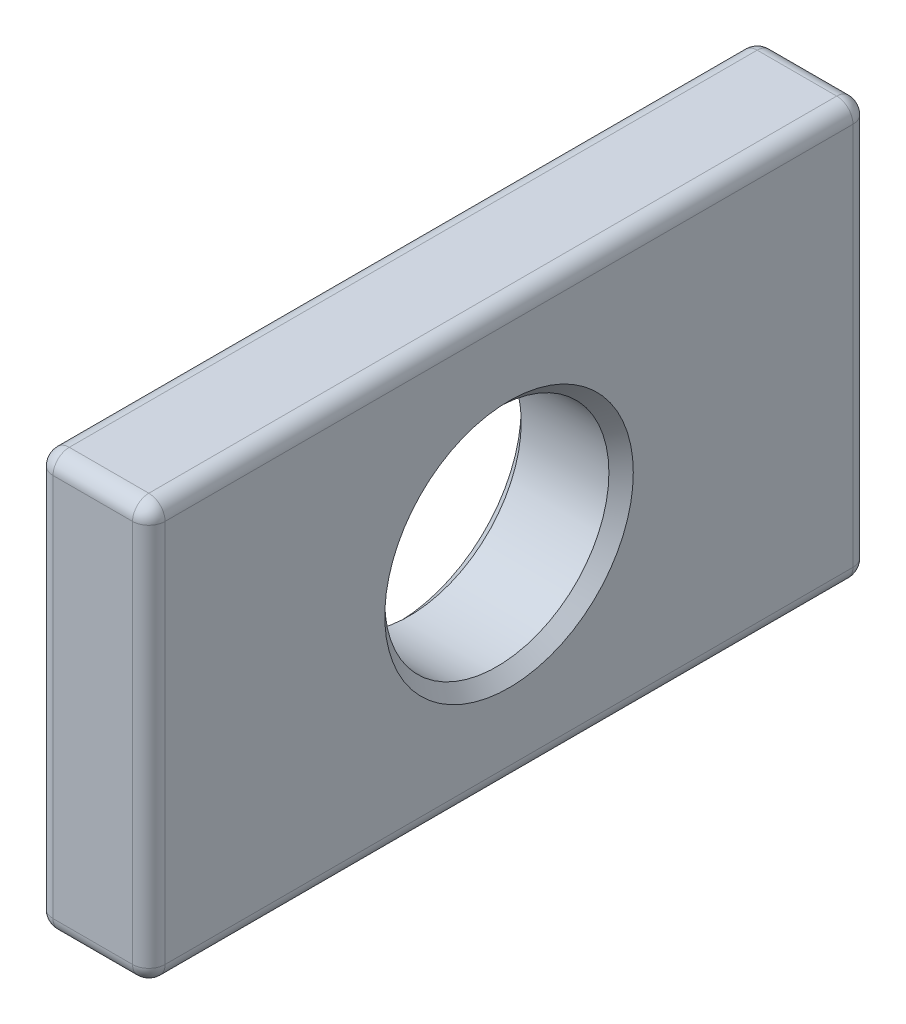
ISO-10303-21;
HEADER;
FILE_DESCRIPTION(('STEP AP214'),'2;1');
FILE_NAME('part.step','',(''),(''),'','','');
FILE_SCHEMA(('AUTOMOTIVE_DESIGN { 1 0 10303 214 1 1 1 1 }'));
ENDSEC;
DATA;
#1=APPLICATION_CONTEXT('core data for automotive mechanical design processes');
#2=APPLICATION_PROTOCOL_DEFINITION('international standard','automotive_design',2000,#1);
#3=PRODUCT_CONTEXT('',#1,'mechanical');
#4=PRODUCT('Part','Part','',(#3));
#5=PRODUCT_RELATED_PRODUCT_CATEGORY('part','',(#4));
#6=PRODUCT_DEFINITION_FORMATION('','',#4);
#7=PRODUCT_DEFINITION_CONTEXT('part definition',#1,'design');
#8=PRODUCT_DEFINITION('design','',#6,#7);
#9=PRODUCT_DEFINITION_SHAPE('','',#8);
#10=(LENGTH_UNIT() NAMED_UNIT(*) SI_UNIT(.MILLI.,.METRE.));
#11=(NAMED_UNIT(*) PLANE_ANGLE_UNIT() SI_UNIT($,.RADIAN.));
#12=(NAMED_UNIT(*) SI_UNIT($,.STERADIAN.) SOLID_ANGLE_UNIT());
#13=UNCERTAINTY_MEASURE_WITH_UNIT(LENGTH_MEASURE(1.E-05),#10,'distance_accuracy_value','');
#14=(GEOMETRIC_REPRESENTATION_CONTEXT(3) GLOBAL_UNCERTAINTY_ASSIGNED_CONTEXT((#13)) GLOBAL_UNIT_ASSIGNED_CONTEXT((#10,
#11,#12)) REPRESENTATION_CONTEXT('',''));
#15=CARTESIAN_POINT('',(0.,0.,0.));
#16=DIRECTION('',(0.,0.,1.));
#17=DIRECTION('',(1.,0.,0.));
#18=AXIS2_PLACEMENT_3D('',#15,#16,#17);
#19=CARTESIAN_POINT('',(3.5,0.,0.));
#20=DIRECTION('',(1.,0.,0.));
#21=DIRECTION('',(0.,0.,-1.));
#22=AXIS2_PLACEMENT_3D('',#19,#20,#21);
#23=PLANE('',#22);
#24=CARTESIAN_POINT('',(3.5,0.,0.));
#25=DIRECTION('',(1.,0.,0.));
#26=DIRECTION('',(0.,0.,-1.));
#27=AXIS2_PLACEMENT_3D('',#24,#25,#26);
#28=CIRCLE('',#27,7.762);
#29=CARTESIAN_POINT('',(3.5,0.,-7.762));
#30=VERTEX_POINT('',#29);
#31=EDGE_CURVE('E11',#30,#30,#28,.F.);
#32=ORIENTED_EDGE('',*,*,#31,.T.);
#33=EDGE_LOOP('',(#32));
#34=FACE_BOUND('',#33,.T.);
#35=DIRECTION('',(0.,0.,-1.));
#36=VECTOR('',#35,1.);
#37=CARTESIAN_POINT('',(3.5,-11.984,-22.5));
#38=LINE('',#37,#36);
#39=CARTESIAN_POINT('',(3.5,-11.984,21.484));
#40=VERTEX_POINT('',#39);
#41=CARTESIAN_POINT('',(3.5,-11.984,-21.484));
#42=VERTEX_POINT('',#41);
#43=EDGE_CURVE('E130',#40,#42,#38,.T.);
#44=ORIENTED_EDGE('',*,*,#43,.T.);
#45=DIRECTION('',(0.,1.,0.));
#46=VECTOR('',#45,1.);
#47=CARTESIAN_POINT('',(3.5,13.,-21.484));
#48=LINE('',#47,#46);
#49=CARTESIAN_POINT('',(3.5,11.984,-21.484));
#50=VERTEX_POINT('',#49);
#51=EDGE_CURVE('E126',#42,#50,#48,.T.);
#52=ORIENTED_EDGE('',*,*,#51,.T.);
#53=DIRECTION('',(0.,0.,1.));
#54=VECTOR('',#53,1.);
#55=CARTESIAN_POINT('',(3.5,11.984,22.5));
#56=LINE('',#55,#54);
#57=CARTESIAN_POINT('',(3.5,11.984,21.484));
#58=VERTEX_POINT('',#57);
#59=EDGE_CURVE('E119',#50,#58,#56,.T.);
#60=ORIENTED_EDGE('',*,*,#59,.T.);
#61=DIRECTION('',(0.,-1.,0.));
#62=VECTOR('',#61,1.);
#63=CARTESIAN_POINT('',(3.5,-13.,21.484));
#64=LINE('',#63,#62);
#65=EDGE_CURVE('E123',#58,#40,#64,.T.);
#66=ORIENTED_EDGE('',*,*,#65,.T.);
#67=EDGE_LOOP('',(#44,#52,#60,#66));
#68=FACE_BOUND('',#67,.T.);
#69=ADVANCED_FACE('F32',(#34,#68),#23,.T.);
#70=CARTESIAN_POINT('',(-3.5,0.,0.));
#71=DIRECTION('',(1.,0.,0.));
#72=DIRECTION('',(0.,0.,-1.));
#73=AXIS2_PLACEMENT_3D('',#70,#71,#72);
#74=PLANE('',#73);
#75=CARTESIAN_POINT('',(-3.5,0.,0.));
#76=DIRECTION('',(1.,0.,0.));
#77=DIRECTION('',(0.,0.,-1.));
#78=AXIS2_PLACEMENT_3D('',#75,#76,#77);
#79=CIRCLE('',#78,7.76200000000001);
#80=CARTESIAN_POINT('',(-3.5,0.,-7.762));
#81=VERTEX_POINT('',#80);
#82=EDGE_CURVE('E204',#81,#81,#79,.T.);
#83=ORIENTED_EDGE('',*,*,#82,.T.);
#84=EDGE_LOOP('',(#83));
#85=FACE_BOUND('',#84,.T.);
#86=DIRECTION('',(0.,0.,1.));
#87=VECTOR('',#86,1.);
#88=CARTESIAN_POINT('',(-3.5,11.984,0.));
#89=LINE('',#88,#87);
#90=CARTESIAN_POINT('',(-3.5,11.984,21.484));
#91=VERTEX_POINT('',#90);
#92=CARTESIAN_POINT('',(-3.5,11.984,-21.484));
#93=VERTEX_POINT('',#92);
#94=EDGE_CURVE('E175',#91,#93,#89,.F.);
#95=ORIENTED_EDGE('',*,*,#94,.T.);
#96=DIRECTION('',(0.,1.,0.));
#97=VECTOR('',#96,1.);
#98=CARTESIAN_POINT('',(-3.5,0.,-21.484));
#99=LINE('',#98,#97);
#100=CARTESIAN_POINT('',(-3.5,-11.984,-21.484));
#101=VERTEX_POINT('',#100);
#102=EDGE_CURVE('E180',#93,#101,#99,.F.);
#103=ORIENTED_EDGE('',*,*,#102,.T.);
#104=DIRECTION('',(0.,0.,-1.));
#105=VECTOR('',#104,1.);
#106=CARTESIAN_POINT('',(-3.5,-11.984,0.));
#107=LINE('',#106,#105);
#108=CARTESIAN_POINT('',(-3.5,-11.984,21.484));
#109=VERTEX_POINT('',#108);
#110=EDGE_CURVE('E177',#101,#109,#107,.F.);
#111=ORIENTED_EDGE('',*,*,#110,.T.);
#112=DIRECTION('',(0.,-1.,0.));
#113=VECTOR('',#112,1.);
#114=CARTESIAN_POINT('',(-3.5,0.,21.484));
#115=LINE('',#114,#113);
#116=EDGE_CURVE('E173',#109,#91,#115,.F.);
#117=ORIENTED_EDGE('',*,*,#116,.T.);
#118=EDGE_LOOP('',(#95,#103,#111,#117));
#119=FACE_BOUND('',#118,.T.);
#120=ADVANCED_FACE('F270',(#85,#119),#74,.F.);
#121=CARTESIAN_POINT('',(3.5,13.,-22.5));
#122=DIRECTION('',(0.,0.,1.));
#123=DIRECTION('',(0.,-1.,0.));
#124=AXIS2_PLACEMENT_3D('',#121,#122,#123);
#125=PLANE('',#124);
#126=DIRECTION('',(0.,1.,0.));
#127=VECTOR('',#126,1.);
#128=CARTESIAN_POINT('',(2.484,-13.,-22.5));
#129=LINE('',#128,#127);
#130=CARTESIAN_POINT('',(2.484,11.984,-22.5));
#131=VERTEX_POINT('',#130);
#132=CARTESIAN_POINT('',(2.484,-11.984,-22.5));
#133=VERTEX_POINT('',#132);
#134=EDGE_CURVE('E193',#131,#133,#129,.F.);
#135=ORIENTED_EDGE('',*,*,#134,.T.);
#136=DIRECTION('',(-1.,0.,0.));
#137=VECTOR('',#136,1.);
#138=CARTESIAN_POINT('',(3.5,-11.984,-22.5));
#139=LINE('',#138,#137);
#140=CARTESIAN_POINT('',(-2.484,-11.984,-22.5));
#141=VERTEX_POINT('',#140);
#142=EDGE_CURVE('E195',#133,#141,#139,.T.);
#143=ORIENTED_EDGE('',*,*,#142,.T.);
#144=DIRECTION('',(0.,1.,0.));
#145=VECTOR('',#144,1.);
#146=CARTESIAN_POINT('',(-2.484,13.,-22.5));
#147=LINE('',#146,#145);
#148=CARTESIAN_POINT('',(-2.484,11.984,-22.5));
#149=VERTEX_POINT('',#148);
#150=EDGE_CURVE('E189',#141,#149,#147,.T.);
#151=ORIENTED_EDGE('',*,*,#150,.T.);
#152=DIRECTION('',(-1.,0.,0.));
#153=VECTOR('',#152,1.);
#154=CARTESIAN_POINT('',(3.5,11.984,-22.5));
#155=LINE('',#154,#153);
#156=EDGE_CURVE('E191',#149,#131,#155,.F.);
#157=ORIENTED_EDGE('',*,*,#156,.T.);
#158=EDGE_LOOP('',(#135,#143,#151,#157));
#159=FACE_BOUND('',#158,.T.);
#160=ADVANCED_FACE('F273',(#159),#125,.F.);
#161=CARTESIAN_POINT('',(3.5,13.,22.5));
#162=DIRECTION('',(0.,-1.,0.));
#163=DIRECTION('',(0.,0.,-1.));
#164=AXIS2_PLACEMENT_3D('',#161,#162,#163);
#165=PLANE('',#164);
#166=DIRECTION('',(0.,0.,1.));
#167=VECTOR('',#166,1.);
#168=CARTESIAN_POINT('',(2.484,13.,-22.5));
#169=LINE('',#168,#167);
#170=CARTESIAN_POINT('',(2.484,13.,21.484));
#171=VERTEX_POINT('',#170);
#172=CARTESIAN_POINT('',(2.484,13.,-21.484));
#173=VERTEX_POINT('',#172);
#174=EDGE_CURVE('E138',#171,#173,#169,.F.);
#175=ORIENTED_EDGE('',*,*,#174,.T.);
#176=DIRECTION('',(-1.,0.,0.));
#177=VECTOR('',#176,1.);
#178=CARTESIAN_POINT('',(3.5,13.,-21.484));
#179=LINE('',#178,#177);
#180=CARTESIAN_POINT('',(-2.484,13.,-21.484));
#181=VERTEX_POINT('',#180);
#182=EDGE_CURVE('E187',#173,#181,#179,.T.);
#183=ORIENTED_EDGE('',*,*,#182,.T.);
#184=DIRECTION('',(0.,0.,1.));
#185=VECTOR('',#184,1.);
#186=CARTESIAN_POINT('',(-2.484,13.,22.5));
#187=LINE('',#186,#185);
#188=CARTESIAN_POINT('',(-2.484,13.,21.484));
#189=VERTEX_POINT('',#188);
#190=EDGE_CURVE('E184',#181,#189,#187,.T.);
#191=ORIENTED_EDGE('',*,*,#190,.T.);
#192=DIRECTION('',(-1.,0.,0.));
#193=VECTOR('',#192,1.);
#194=CARTESIAN_POINT('',(3.5,13.,21.484));
#195=LINE('',#194,#193);
#196=EDGE_CURVE('E182',#189,#171,#195,.F.);
#197=ORIENTED_EDGE('',*,*,#196,.T.);
#198=EDGE_LOOP('',(#175,#183,#191,#197));
#199=FACE_BOUND('',#198,.T.);
#200=ADVANCED_FACE('F317',(#199),#165,.F.);
#201=CARTESIAN_POINT('',(3.5,13.,22.5));
#202=DIRECTION('',(0.,0.,-1.));
#203=DIRECTION('',(-1.,0.,0.));
#204=AXIS2_PLACEMENT_3D('',#201,#202,#203);
#205=PLANE('',#204);
#206=DIRECTION('',(0.,-1.,0.));
#207=VECTOR('',#206,1.);
#208=CARTESIAN_POINT('',(2.484,13.,22.5));
#209=LINE('',#208,#207);
#210=CARTESIAN_POINT('',(2.484,-11.984,22.5));
#211=VERTEX_POINT('',#210);
#212=CARTESIAN_POINT('',(2.484,11.984,22.5));
#213=VERTEX_POINT('',#212);
#214=EDGE_CURVE('E47',#211,#213,#209,.F.);
#215=ORIENTED_EDGE('',*,*,#214,.T.);
#216=DIRECTION('',(-1.,0.,0.));
#217=VECTOR('',#216,1.);
#218=CARTESIAN_POINT('',(3.5,11.984,22.5));
#219=LINE('',#218,#217);
#220=CARTESIAN_POINT('',(-2.484,11.984,22.5));
#221=VERTEX_POINT('',#220);
#222=EDGE_CURVE('E202',#213,#221,#219,.T.);
#223=ORIENTED_EDGE('',*,*,#222,.T.);
#224=DIRECTION('',(0.,-1.,0.));
#225=VECTOR('',#224,1.);
#226=CARTESIAN_POINT('',(-2.484,13.,22.5));
#227=LINE('',#226,#225);
#228=CARTESIAN_POINT('',(-2.484,-11.984,22.5));
#229=VERTEX_POINT('',#228);
#230=EDGE_CURVE('E198',#221,#229,#227,.T.);
#231=ORIENTED_EDGE('',*,*,#230,.T.);
#232=DIRECTION('',(-1.,0.,0.));
#233=VECTOR('',#232,1.);
#234=CARTESIAN_POINT('',(3.5,-11.984,22.5));
#235=LINE('',#234,#233);
#236=EDGE_CURVE('E52',#229,#211,#235,.F.);
#237=ORIENTED_EDGE('',*,*,#236,.T.);
#238=EDGE_LOOP('',(#215,#223,#231,#237));
#239=FACE_BOUND('',#238,.T.);
#240=ADVANCED_FACE('F314',(#239),#205,.F.);
#241=CARTESIAN_POINT('',(3.5,-13.,22.5));
#242=DIRECTION('',(0.,1.,0.));
#243=DIRECTION('',(0.,0.,1.));
#244=AXIS2_PLACEMENT_3D('',#241,#242,#243);
#245=PLANE('',#244);
#246=DIRECTION('',(0.,0.,-1.));
#247=VECTOR('',#246,1.);
#248=CARTESIAN_POINT('',(-2.484,-13.,22.5));
#249=LINE('',#248,#247);
#250=CARTESIAN_POINT('',(-2.484,-13.,21.484));
#251=VERTEX_POINT('',#250);
#252=CARTESIAN_POINT('',(-2.484,-13.,-21.484));
#253=VERTEX_POINT('',#252);
#254=EDGE_CURVE('E166',#251,#253,#249,.T.);
#255=ORIENTED_EDGE('',*,*,#254,.T.);
#256=DIRECTION('',(-1.,0.,0.));
#257=VECTOR('',#256,1.);
#258=CARTESIAN_POINT('',(3.5,-13.,-21.484));
#259=LINE('',#258,#257);
#260=CARTESIAN_POINT('',(2.484,-13.,-21.484));
#261=VERTEX_POINT('',#260);
#262=EDGE_CURVE('E171',#253,#261,#259,.F.);
#263=ORIENTED_EDGE('',*,*,#262,.T.);
#264=DIRECTION('',(0.,0.,-1.));
#265=VECTOR('',#264,1.);
#266=CARTESIAN_POINT('',(2.484,-13.,22.5));
#267=LINE('',#266,#265);
#268=CARTESIAN_POINT('',(2.484,-13.,21.484));
#269=VERTEX_POINT('',#268);
#270=EDGE_CURVE('E168',#261,#269,#267,.F.);
#271=ORIENTED_EDGE('',*,*,#270,.T.);
#272=DIRECTION('',(-1.,0.,0.));
#273=VECTOR('',#272,1.);
#274=CARTESIAN_POINT('',(3.5,-13.,21.484));
#275=LINE('',#274,#273);
#276=EDGE_CURVE('E164',#269,#251,#275,.T.);
#277=ORIENTED_EDGE('',*,*,#276,.T.);
#278=EDGE_LOOP('',(#255,#263,#271,#277));
#279=FACE_BOUND('',#278,.T.);
#280=ADVANCED_FACE('F316',(#279),#245,.F.);
#281=CARTESIAN_POINT('',(3.5,0.,0.));
#282=DIRECTION('',(-1.,0.,0.));
#283=DIRECTION('',(0.,0.,1.));
#284=AXIS2_PLACEMENT_3D('',#281,#282,#283);
#285=CYLINDRICAL_SURFACE('',#284,7.);
#286=CARTESIAN_POINT('',(-2.73799999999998,0.,0.));
#287=DIRECTION('',(1.,0.,0.));
#288=DIRECTION('',(0.,0.,-1.));
#289=AXIS2_PLACEMENT_3D('',#286,#287,#288);
#290=CIRCLE('',#289,7.);
#291=CARTESIAN_POINT('',(-2.73799999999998,0.,-6.99999999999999));
#292=VERTEX_POINT('',#291);
#293=EDGE_CURVE('E40',#292,#292,#290,.F.);
#294=ORIENTED_EDGE('',*,*,#293,.T.);
#295=EDGE_LOOP('',(#294));
#296=FACE_BOUND('',#295,.T.);
#297=CARTESIAN_POINT('',(2.738,0.,0.));
#298=DIRECTION('',(1.,0.,0.));
#299=DIRECTION('',(0.,0.,-1.));
#300=AXIS2_PLACEMENT_3D('',#297,#298,#299);
#301=CIRCLE('',#300,7.);
#302=CARTESIAN_POINT('',(2.738,0.,-6.99999999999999));
#303=VERTEX_POINT('',#302);
#304=EDGE_CURVE('E256',#303,#303,#301,.T.);
#305=ORIENTED_EDGE('',*,*,#304,.T.);
#306=EDGE_LOOP('',(#305));
#307=FACE_BOUND('',#306,.T.);
#308=ADVANCED_FACE('F261',(#296,#307),#285,.F.);
#309=CARTESIAN_POINT('',(-2.484,11.984,22.5));
#310=DIRECTION('',(0.,0.,1.));
#311=DIRECTION('',(1.,0.,0.));
#312=AXIS2_PLACEMENT_3D('',#309,#310,#311);
#313=CYLINDRICAL_SURFACE('',#312,1.016);
#314=CARTESIAN_POINT('',(-2.484,11.984,21.484));
#315=DIRECTION('',(0.,0.,1.));
#316=DIRECTION('',(1.,0.,0.));
#317=AXIS2_PLACEMENT_3D('',#314,#315,#316);
#318=CIRCLE('',#317,1.016);
#319=EDGE_CURVE('E156',#189,#91,#318,.T.);
#320=ORIENTED_EDGE('',*,*,#319,.F.);
#321=ORIENTED_EDGE('',*,*,#190,.F.);
#322=CARTESIAN_POINT('',(-2.484,11.984,-21.484));
#323=DIRECTION('',(0.,0.,-1.));
#324=DIRECTION('',(0.,1.,0.));
#325=AXIS2_PLACEMENT_3D('',#322,#323,#324);
#326=CIRCLE('',#325,1.016);
#327=EDGE_CURVE('E159',#93,#181,#326,.T.);
#328=ORIENTED_EDGE('',*,*,#327,.F.);
#329=ORIENTED_EDGE('',*,*,#94,.F.);
#330=EDGE_LOOP('',(#320,#321,#328,#329));
#331=FACE_BOUND('',#330,.T.);
#332=ADVANCED_FACE('F284',(#331),#313,.T.);
#333=CARTESIAN_POINT('',(-2.484,11.984,21.484));
#334=DIRECTION('',(0.,0.,1.));
#335=DIRECTION('',(1.,0.,0.));
#336=AXIS2_PLACEMENT_3D('',#333,#334,#335);
#337=SPHERICAL_SURFACE('',#336,1.016);
#338=CARTESIAN_POINT('',(-2.484,11.984,21.484));
#339=DIRECTION('',(-1.,0.,0.));
#340=DIRECTION('',(0.,0.,1.));
#341=AXIS2_PLACEMENT_3D('',#338,#339,#340);
#342=CIRCLE('',#341,1.016);
#343=EDGE_CURVE('E246',#189,#221,#342,.F.);
#344=ORIENTED_EDGE('',*,*,#343,.F.);
#345=ORIENTED_EDGE('',*,*,#319,.T.);
#346=CARTESIAN_POINT('',(-2.484,11.984,21.484));
#347=DIRECTION('',(0.,1.,0.));
#348=DIRECTION('',(0.,0.,1.));
#349=AXIS2_PLACEMENT_3D('',#346,#347,#348);
#350=CIRCLE('',#349,1.016);
#351=EDGE_CURVE('E249',#221,#91,#350,.F.);
#352=ORIENTED_EDGE('',*,*,#351,.F.);
#353=EDGE_LOOP('',(#344,#345,#352));
#354=FACE_BOUND('',#353,.T.);
#355=ADVANCED_FACE('F310',(#354),#337,.T.);
#356=CARTESIAN_POINT('',(-2.484,11.984,-21.484));
#357=DIRECTION('',(0.,0.,1.));
#358=DIRECTION('',(1.,0.,0.));
#359=AXIS2_PLACEMENT_3D('',#356,#357,#358);
#360=SPHERICAL_SURFACE('',#359,1.016);
#361=CARTESIAN_POINT('',(-2.484,11.984,-21.484));
#362=DIRECTION('',(0.,1.,0.));
#363=DIRECTION('',(0.,0.,1.));
#364=AXIS2_PLACEMENT_3D('',#361,#362,#363);
#365=CIRCLE('',#364,1.016);
#366=EDGE_CURVE('E240',#93,#149,#365,.F.);
#367=ORIENTED_EDGE('',*,*,#366,.F.);
#368=ORIENTED_EDGE('',*,*,#327,.T.);
#369=CARTESIAN_POINT('',(-2.484,11.984,-21.484));
#370=DIRECTION('',(-1.,0.,0.));
#371=DIRECTION('',(0.,0.,1.));
#372=AXIS2_PLACEMENT_3D('',#369,#370,#371);
#373=CIRCLE('',#372,1.016);
#374=EDGE_CURVE('E243',#149,#181,#373,.F.);
#375=ORIENTED_EDGE('',*,*,#374,.F.);
#376=EDGE_LOOP('',(#367,#368,#375));
#377=FACE_BOUND('',#376,.T.);
#378=ADVANCED_FACE('F287',(#377),#360,.T.);
#379=CARTESIAN_POINT('',(-2.484,13.,21.484));
#380=DIRECTION('',(0.,-1.,0.));
#381=DIRECTION('',(0.,0.,-1.));
#382=AXIS2_PLACEMENT_3D('',#379,#380,#381);
#383=CYLINDRICAL_SURFACE('',#382,1.016);
#384=ORIENTED_EDGE('',*,*,#351,.T.);
#385=ORIENTED_EDGE('',*,*,#116,.F.);
#386=CARTESIAN_POINT('',(-2.484,-11.984,21.484));
#387=DIRECTION('',(0.,-1.,0.));
#388=DIRECTION('',(0.,0.,-1.));
#389=AXIS2_PLACEMENT_3D('',#386,#387,#388);
#390=CIRCLE('',#389,1.016);
#391=EDGE_CURVE('E235',#229,#109,#390,.T.);
#392=ORIENTED_EDGE('',*,*,#391,.F.);
#393=ORIENTED_EDGE('',*,*,#230,.F.);
#394=EDGE_LOOP('',(#384,#385,#392,#393));
#395=FACE_BOUND('',#394,.T.);
#396=ADVANCED_FACE('F306',(#395),#383,.T.);
#397=CARTESIAN_POINT('',(3.5,11.984,21.484));
#398=DIRECTION('',(-1.,0.,0.));
#399=DIRECTION('',(0.,0.,1.));
#400=AXIS2_PLACEMENT_3D('',#397,#398,#399);
#401=CYLINDRICAL_SURFACE('',#400,1.016);
#402=ORIENTED_EDGE('',*,*,#343,.T.);
#403=ORIENTED_EDGE('',*,*,#222,.F.);
#404=CARTESIAN_POINT('',(2.484,11.984,21.484));
#405=DIRECTION('',(1.,0.,0.));
#406=DIRECTION('',(0.,0.,-1.));
#407=AXIS2_PLACEMENT_3D('',#404,#405,#406);
#408=CIRCLE('',#407,1.016);
#409=EDGE_CURVE('E142',#171,#213,#408,.T.);
#410=ORIENTED_EDGE('',*,*,#409,.F.);
#411=ORIENTED_EDGE('',*,*,#196,.F.);
#412=EDGE_LOOP('',(#402,#403,#410,#411));
#413=FACE_BOUND('',#412,.T.);
#414=ADVANCED_FACE('F313',(#413),#401,.T.);
#415=CARTESIAN_POINT('',(2.484,11.984,0.));
#416=DIRECTION('',(0.,0.,-1.));
#417=DIRECTION('',(-1.,0.,0.));
#418=AXIS2_PLACEMENT_3D('',#415,#416,#417);
#419=CYLINDRICAL_SURFACE('',#418,1.016);
#420=CARTESIAN_POINT('',(2.484,11.984,-21.484));
#421=DIRECTION('',(0.,0.,-1.));
#422=DIRECTION('',(-1.,0.,0.));
#423=AXIS2_PLACEMENT_3D('',#420,#421,#422);
#424=CIRCLE('',#423,1.016);
#425=EDGE_CURVE('E143',#173,#50,#424,.T.);
#426=ORIENTED_EDGE('',*,*,#425,.F.);
#427=ORIENTED_EDGE('',*,*,#174,.F.);
#428=CARTESIAN_POINT('',(2.484,11.984,21.484));
#429=DIRECTION('',(0.,0.,1.));
#430=DIRECTION('',(1.,0.,0.));
#431=AXIS2_PLACEMENT_3D('',#428,#429,#430);
#432=CIRCLE('',#431,1.016);
#433=EDGE_CURVE('E134',#58,#171,#432,.T.);
#434=ORIENTED_EDGE('',*,*,#433,.F.);
#435=ORIENTED_EDGE('',*,*,#59,.F.);
#436=EDGE_LOOP('',(#426,#427,#434,#435));
#437=FACE_BOUND('',#436,.T.);
#438=ADVANCED_FACE('F136',(#437),#419,.T.);
#439=CARTESIAN_POINT('',(3.5,11.984,-21.484));
#440=DIRECTION('',(-1.,0.,0.));
#441=DIRECTION('',(0.,0.,1.));
#442=AXIS2_PLACEMENT_3D('',#439,#440,#441);
#443=CYLINDRICAL_SURFACE('',#442,1.016);
#444=ORIENTED_EDGE('',*,*,#374,.T.);
#445=ORIENTED_EDGE('',*,*,#182,.F.);
#446=CARTESIAN_POINT('',(2.484,11.984,-21.484));
#447=DIRECTION('',(1.,0.,0.));
#448=DIRECTION('',(0.,0.,-1.));
#449=AXIS2_PLACEMENT_3D('',#446,#447,#448);
#450=CIRCLE('',#449,1.016);
#451=EDGE_CURVE('E231',#131,#173,#450,.T.);
#452=ORIENTED_EDGE('',*,*,#451,.F.);
#453=ORIENTED_EDGE('',*,*,#156,.F.);
#454=EDGE_LOOP('',(#444,#445,#452,#453));
#455=FACE_BOUND('',#454,.T.);
#456=ADVANCED_FACE('F351',(#455),#443,.T.);
#457=CARTESIAN_POINT('',(-2.484,13.,-21.484));
#458=DIRECTION('',(0.,1.,0.));
#459=DIRECTION('',(0.,0.,1.));
#460=AXIS2_PLACEMENT_3D('',#457,#458,#459);
#461=CYLINDRICAL_SURFACE('',#460,1.016);
#462=ORIENTED_EDGE('',*,*,#366,.T.);
#463=ORIENTED_EDGE('',*,*,#150,.F.);
#464=CARTESIAN_POINT('',(-2.484,-11.984,-21.484));
#465=DIRECTION('',(0.,-1.,0.));
#466=DIRECTION('',(0.,0.,-1.));
#467=AXIS2_PLACEMENT_3D('',#464,#465,#466);
#468=CIRCLE('',#467,1.016);
#469=EDGE_CURVE('E228',#101,#141,#468,.T.);
#470=ORIENTED_EDGE('',*,*,#469,.F.);
#471=ORIENTED_EDGE('',*,*,#102,.F.);
#472=EDGE_LOOP('',(#462,#463,#470,#471));
#473=FACE_BOUND('',#472,.T.);
#474=ADVANCED_FACE('F292',(#473),#461,.T.);
#475=CARTESIAN_POINT('',(-2.484,-11.984,22.5));
#476=DIRECTION('',(0.,0.,-1.));
#477=DIRECTION('',(-1.,0.,0.));
#478=AXIS2_PLACEMENT_3D('',#475,#476,#477);
#479=CYLINDRICAL_SURFACE('',#478,1.016);
#480=CARTESIAN_POINT('',(-2.484,-11.984,21.484));
#481=DIRECTION('',(0.,0.,1.));
#482=DIRECTION('',(1.,0.,0.));
#483=AXIS2_PLACEMENT_3D('',#480,#481,#482);
#484=CIRCLE('',#483,1.016);
#485=EDGE_CURVE('E237',#109,#251,#484,.T.);
#486=ORIENTED_EDGE('',*,*,#485,.F.);
#487=ORIENTED_EDGE('',*,*,#110,.F.);
#488=CARTESIAN_POINT('',(-2.484,-11.984,-21.484));
#489=DIRECTION('',(0.,0.,-1.));
#490=DIRECTION('',(-1.,0.,0.));
#491=AXIS2_PLACEMENT_3D('',#488,#489,#490);
#492=CIRCLE('',#491,1.016);
#493=EDGE_CURVE('E225',#253,#101,#492,.T.);
#494=ORIENTED_EDGE('',*,*,#493,.F.);
#495=ORIENTED_EDGE('',*,*,#254,.F.);
#496=EDGE_LOOP('',(#486,#487,#494,#495));
#497=FACE_BOUND('',#496,.T.);
#498=ADVANCED_FACE('F301',(#497),#479,.T.);
#499=CARTESIAN_POINT('',(-2.484,-11.984,21.484));
#500=DIRECTION('',(0.,0.,1.));
#501=DIRECTION('',(1.,0.,0.));
#502=AXIS2_PLACEMENT_3D('',#499,#500,#501);
#503=SPHERICAL_SURFACE('',#502,1.016);
#504=ORIENTED_EDGE('',*,*,#391,.T.);
#505=ORIENTED_EDGE('',*,*,#485,.T.);
#506=CARTESIAN_POINT('',(-2.484,-11.984,21.484));
#507=DIRECTION('',(-1.,0.,0.));
#508=DIRECTION('',(0.,0.,1.));
#509=AXIS2_PLACEMENT_3D('',#506,#507,#508);
#510=CIRCLE('',#509,1.016);
#511=EDGE_CURVE('E149',#229,#251,#510,.F.);
#512=ORIENTED_EDGE('',*,*,#511,.F.);
#513=EDGE_LOOP('',(#504,#505,#512));
#514=FACE_BOUND('',#513,.T.);
#515=ADVANCED_FACE('F359',(#514),#503,.T.);
#516=CARTESIAN_POINT('',(2.484,11.984,21.484));
#517=DIRECTION('',(0.,0.,1.));
#518=DIRECTION('',(1.,0.,0.));
#519=AXIS2_PLACEMENT_3D('',#516,#517,#518);
#520=SPHERICAL_SURFACE('',#519,1.016);
#521=ORIENTED_EDGE('',*,*,#433,.T.);
#522=ORIENTED_EDGE('',*,*,#409,.T.);
#523=CARTESIAN_POINT('',(2.484,11.984,21.484));
#524=DIRECTION('',(0.,1.,0.));
#525=DIRECTION('',(0.,0.,1.));
#526=AXIS2_PLACEMENT_3D('',#523,#524,#525);
#527=CIRCLE('',#526,1.016);
#528=EDGE_CURVE('E146',#58,#213,#527,.F.);
#529=ORIENTED_EDGE('',*,*,#528,.F.);
#530=EDGE_LOOP('',(#521,#522,#529));
#531=FACE_BOUND('',#530,.T.);
#532=ADVANCED_FACE('F147',(#531),#520,.T.);
#533=CARTESIAN_POINT('',(2.484,11.984,-21.484));
#534=DIRECTION('',(0.,0.,1.));
#535=DIRECTION('',(1.,0.,0.));
#536=AXIS2_PLACEMENT_3D('',#533,#534,#535);
#537=SPHERICAL_SURFACE('',#536,1.016);
#538=ORIENTED_EDGE('',*,*,#451,.T.);
#539=ORIENTED_EDGE('',*,*,#425,.T.);
#540=CARTESIAN_POINT('',(2.484,11.984,-21.484));
#541=DIRECTION('',(0.,1.,0.));
#542=DIRECTION('',(0.,0.,1.));
#543=AXIS2_PLACEMENT_3D('',#540,#541,#542);
#544=CIRCLE('',#543,1.016);
#545=EDGE_CURVE('E150',#131,#50,#544,.F.);
#546=ORIENTED_EDGE('',*,*,#545,.F.);
#547=EDGE_LOOP('',(#538,#539,#546));
#548=FACE_BOUND('',#547,.T.);
#549=ADVANCED_FACE('F364',(#548),#537,.T.);
#550=CARTESIAN_POINT('',(-2.484,-11.984,-21.484));
#551=DIRECTION('',(0.,0.,1.));
#552=DIRECTION('',(1.,0.,0.));
#553=AXIS2_PLACEMENT_3D('',#550,#551,#552);
#554=SPHERICAL_SURFACE('',#553,1.016);
#555=ORIENTED_EDGE('',*,*,#493,.T.);
#556=ORIENTED_EDGE('',*,*,#469,.T.);
#557=CARTESIAN_POINT('',(-2.484,-11.984,-21.484));
#558=DIRECTION('',(-1.,0.,0.));
#559=DIRECTION('',(0.,0.,1.));
#560=AXIS2_PLACEMENT_3D('',#557,#558,#559);
#561=CIRCLE('',#560,1.016);
#562=EDGE_CURVE('E219',#253,#141,#561,.F.);
#563=ORIENTED_EDGE('',*,*,#562,.F.);
#564=EDGE_LOOP('',(#555,#556,#563));
#565=FACE_BOUND('',#564,.T.);
#566=ADVANCED_FACE('F296',(#565),#554,.T.);
#567=CARTESIAN_POINT('',(3.5,-11.984,21.484));
#568=DIRECTION('',(-1.,0.,0.));
#569=DIRECTION('',(0.,0.,1.));
#570=AXIS2_PLACEMENT_3D('',#567,#568,#569);
#571=CYLINDRICAL_SURFACE('',#570,1.016);
#572=ORIENTED_EDGE('',*,*,#511,.T.);
#573=ORIENTED_EDGE('',*,*,#276,.F.);
#574=CARTESIAN_POINT('',(2.484,-11.984,21.484));
#575=DIRECTION('',(1.,0.,0.));
#576=DIRECTION('',(0.,0.,-1.));
#577=AXIS2_PLACEMENT_3D('',#574,#575,#576);
#578=CIRCLE('',#577,1.016);
#579=EDGE_CURVE('E216',#211,#269,#578,.T.);
#580=ORIENTED_EDGE('',*,*,#579,.F.);
#581=ORIENTED_EDGE('',*,*,#236,.F.);
#582=EDGE_LOOP('',(#572,#573,#580,#581));
#583=FACE_BOUND('',#582,.T.);
#584=ADVANCED_FACE('F370',(#583),#571,.T.);
#585=CARTESIAN_POINT('',(2.484,0.,21.484));
#586=DIRECTION('',(0.,1.,0.));
#587=DIRECTION('',(0.,0.,1.));
#588=AXIS2_PLACEMENT_3D('',#585,#586,#587);
#589=CYLINDRICAL_SURFACE('',#588,1.016);
#590=ORIENTED_EDGE('',*,*,#528,.T.);
#591=ORIENTED_EDGE('',*,*,#214,.F.);
#592=CARTESIAN_POINT('',(2.484,-11.984,21.484));
#593=DIRECTION('',(0.,-1.,0.));
#594=DIRECTION('',(0.,0.,-1.));
#595=AXIS2_PLACEMENT_3D('',#592,#593,#594);
#596=CIRCLE('',#595,1.016);
#597=EDGE_CURVE('E154',#40,#211,#596,.T.);
#598=ORIENTED_EDGE('',*,*,#597,.F.);
#599=ORIENTED_EDGE('',*,*,#65,.F.);
#600=EDGE_LOOP('',(#590,#591,#598,#599));
#601=FACE_BOUND('',#600,.T.);
#602=ADVANCED_FACE('F152',(#601),#589,.T.);
#603=CARTESIAN_POINT('',(2.484,0.,-21.484));
#604=DIRECTION('',(0.,-1.,0.));
#605=DIRECTION('',(0.,0.,-1.));
#606=AXIS2_PLACEMENT_3D('',#603,#604,#605);
#607=CYLINDRICAL_SURFACE('',#606,1.016);
#608=ORIENTED_EDGE('',*,*,#545,.T.);
#609=ORIENTED_EDGE('',*,*,#51,.F.);
#610=CARTESIAN_POINT('',(2.484,-11.984,-21.484));
#611=DIRECTION('',(0.,-1.,0.));
#612=DIRECTION('',(0.,0.,-1.));
#613=AXIS2_PLACEMENT_3D('',#610,#611,#612);
#614=CIRCLE('',#613,1.016);
#615=EDGE_CURVE('E212',#133,#42,#614,.T.);
#616=ORIENTED_EDGE('',*,*,#615,.F.);
#617=ORIENTED_EDGE('',*,*,#134,.F.);
#618=EDGE_LOOP('',(#608,#609,#616,#617));
#619=FACE_BOUND('',#618,.T.);
#620=ADVANCED_FACE('F376',(#619),#607,.T.);
#621=CARTESIAN_POINT('',(3.5,-11.984,-21.484));
#622=DIRECTION('',(-1.,0.,0.));
#623=DIRECTION('',(0.,0.,1.));
#624=AXIS2_PLACEMENT_3D('',#621,#622,#623);
#625=CYLINDRICAL_SURFACE('',#624,1.016);
#626=ORIENTED_EDGE('',*,*,#562,.T.);
#627=ORIENTED_EDGE('',*,*,#142,.F.);
#628=CARTESIAN_POINT('',(2.484,-11.984,-21.484));
#629=DIRECTION('',(1.,0.,0.));
#630=DIRECTION('',(0.,0.,-1.));
#631=AXIS2_PLACEMENT_3D('',#628,#629,#630);
#632=CIRCLE('',#631,1.016);
#633=EDGE_CURVE('E209',#261,#133,#632,.T.);
#634=ORIENTED_EDGE('',*,*,#633,.F.);
#635=ORIENTED_EDGE('',*,*,#262,.F.);
#636=EDGE_LOOP('',(#626,#627,#634,#635));
#637=FACE_BOUND('',#636,.T.);
#638=ADVANCED_FACE('F379',(#637),#625,.T.);
#639=CARTESIAN_POINT('',(2.484,-11.984,21.484));
#640=DIRECTION('',(0.,0.,1.));
#641=DIRECTION('',(1.,0.,0.));
#642=AXIS2_PLACEMENT_3D('',#639,#640,#641);
#643=SPHERICAL_SURFACE('',#642,1.016);
#644=ORIENTED_EDGE('',*,*,#597,.T.);
#645=ORIENTED_EDGE('',*,*,#579,.T.);
#646=CARTESIAN_POINT('',(2.484,-11.984,21.484));
#647=DIRECTION('',(0.,0.,1.));
#648=DIRECTION('',(1.,0.,0.));
#649=AXIS2_PLACEMENT_3D('',#646,#647,#648);
#650=CIRCLE('',#649,1.016);
#651=EDGE_CURVE('E207',#40,#269,#650,.F.);
#652=ORIENTED_EDGE('',*,*,#651,.F.);
#653=EDGE_LOOP('',(#644,#645,#652));
#654=FACE_BOUND('',#653,.T.);
#655=ADVANCED_FACE('F383',(#654),#643,.T.);
#656=CARTESIAN_POINT('',(2.484,-11.984,-21.484));
#657=DIRECTION('',(0.,0.,1.));
#658=DIRECTION('',(1.,0.,0.));
#659=AXIS2_PLACEMENT_3D('',#656,#657,#658);
#660=SPHERICAL_SURFACE('',#659,1.016);
#661=ORIENTED_EDGE('',*,*,#633,.T.);
#662=ORIENTED_EDGE('',*,*,#615,.T.);
#663=CARTESIAN_POINT('',(2.484,-11.984,-21.484));
#664=DIRECTION('',(0.,0.,-1.));
#665=DIRECTION('',(-1.,0.,0.));
#666=AXIS2_PLACEMENT_3D('',#663,#664,#665);
#667=CIRCLE('',#666,1.016);
#668=EDGE_CURVE('E205',#261,#42,#667,.F.);
#669=ORIENTED_EDGE('',*,*,#668,.F.);
#670=EDGE_LOOP('',(#661,#662,#669));
#671=FACE_BOUND('',#670,.T.);
#672=ADVANCED_FACE('F387',(#671),#660,.T.);
#673=CARTESIAN_POINT('',(2.484,-11.984,0.));
#674=DIRECTION('',(0.,0.,1.));
#675=DIRECTION('',(1.,0.,0.));
#676=AXIS2_PLACEMENT_3D('',#673,#674,#675);
#677=CYLINDRICAL_SURFACE('',#676,1.016);
#678=ORIENTED_EDGE('',*,*,#651,.T.);
#679=ORIENTED_EDGE('',*,*,#270,.F.);
#680=ORIENTED_EDGE('',*,*,#668,.T.);
#681=ORIENTED_EDGE('',*,*,#43,.F.);
#682=EDGE_LOOP('',(#678,#679,#680,#681));
#683=FACE_BOUND('',#682,.T.);
#684=ADVANCED_FACE('F267',(#683),#677,.T.);
#685=CARTESIAN_POINT('',(-3.5,0.,0.));
#686=DIRECTION('',(-1.,0.,0.));
#687=DIRECTION('',(0.,0.,1.));
#688=AXIS2_PLACEMENT_3D('',#685,#686,#687);
#689=CONICAL_SURFACE('',#688,7.76200000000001,0.785398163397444);
#690=ORIENTED_EDGE('',*,*,#293,.F.);
#691=EDGE_LOOP('',(#690));
#692=FACE_BOUND('',#691,.T.);
#693=ORIENTED_EDGE('',*,*,#82,.F.);
#694=EDGE_LOOP('',(#693));
#695=FACE_BOUND('',#694,.T.);
#696=ADVANCED_FACE('F264',(#692,#695),#689,.F.);
#697=CARTESIAN_POINT('',(2.738,0.,0.));
#698=DIRECTION('',(1.,0.,0.));
#699=DIRECTION('',(0.,0.,-1.));
#700=AXIS2_PLACEMENT_3D('',#697,#698,#699);
#701=CONICAL_SURFACE('',#700,7.,0.785398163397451);
#702=ORIENTED_EDGE('',*,*,#31,.F.);
#703=EDGE_LOOP('',(#702));
#704=FACE_BOUND('',#703,.T.);
#705=ORIENTED_EDGE('',*,*,#304,.F.);
#706=EDGE_LOOP('',(#705));
#707=FACE_BOUND('',#706,.T.);
#708=ADVANCED_FACE('F34',(#704,#707),#701,.F.);
#709=CLOSED_SHELL('',(#69,#120,#160,#200,#240,#280,#308,#332,#355,#378,#396,#414,#438,#456,#474,
#498,#515,#532,#549,#566,#584,#602,#620,#638,#655,#672,#684,#696,#708));
#710=MANIFOLD_SOLID_BREP('B2',#709);
#711=ADVANCED_BREP_SHAPE_REPRESENTATION('',(#18,#710),#14);
#712=SHAPE_DEFINITION_REPRESENTATION(#9,#711);
ENDSEC;
END-ISO-10303-21;
